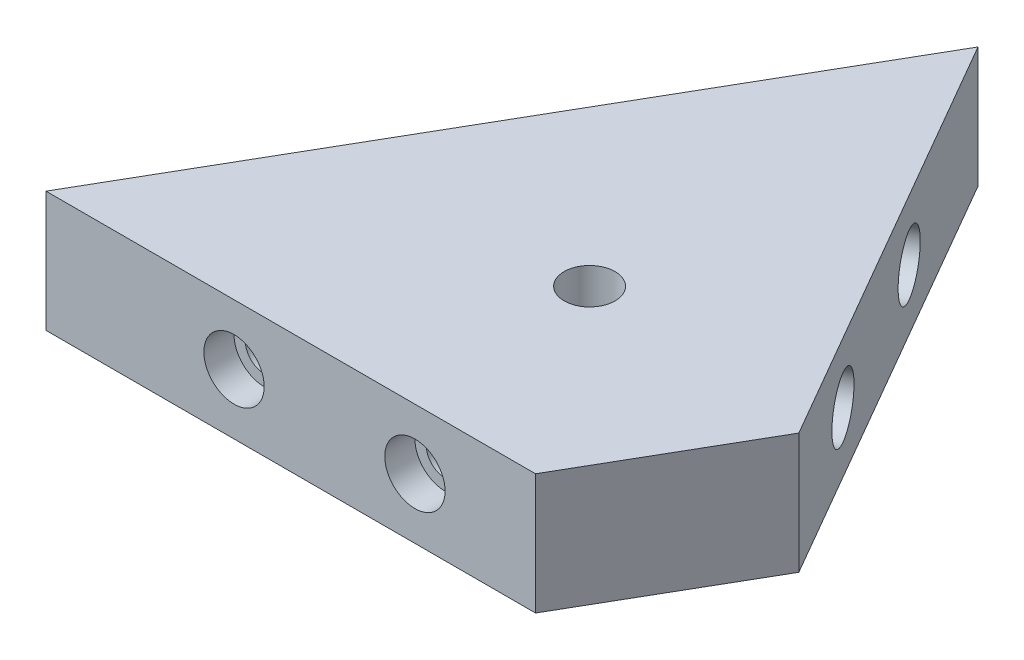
ISO-10303-21;
HEADER;
FILE_DESCRIPTION(('STEP AP214'),'2;1');
FILE_NAME('part.step','',(''),(''),'','','');
FILE_SCHEMA(('AUTOMOTIVE_DESIGN { 1 0 10303 214 1 1 1 1 }'));
ENDSEC;
DATA;
#1=APPLICATION_CONTEXT('core data for automotive mechanical design processes');
#2=APPLICATION_PROTOCOL_DEFINITION('international standard','automotive_design',2000,#1);
#3=PRODUCT_CONTEXT('',#1,'mechanical');
#4=PRODUCT('Part','Part','',(#3));
#5=PRODUCT_RELATED_PRODUCT_CATEGORY('part','',(#4));
#6=PRODUCT_DEFINITION_FORMATION('','',#4);
#7=PRODUCT_DEFINITION_CONTEXT('part definition',#1,'design');
#8=PRODUCT_DEFINITION('design','',#6,#7);
#9=PRODUCT_DEFINITION_SHAPE('','',#8);
#10=(LENGTH_UNIT() NAMED_UNIT(*) SI_UNIT(.MILLI.,.METRE.));
#11=(NAMED_UNIT(*) PLANE_ANGLE_UNIT() SI_UNIT($,.RADIAN.));
#12=(NAMED_UNIT(*) SI_UNIT($,.STERADIAN.) SOLID_ANGLE_UNIT());
#13=UNCERTAINTY_MEASURE_WITH_UNIT(LENGTH_MEASURE(1.E-05),#10,'distance_accuracy_value','');
#14=(GEOMETRIC_REPRESENTATION_CONTEXT(3) GLOBAL_UNCERTAINTY_ASSIGNED_CONTEXT((#13)) GLOBAL_UNIT_ASSIGNED_CONTEXT((#10,
#11,#12)) REPRESENTATION_CONTEXT('',''));
#15=CARTESIAN_POINT('',(0.,0.,0.));
#16=DIRECTION('',(0.,0.,1.));
#17=DIRECTION('',(1.,0.,0.));
#18=AXIS2_PLACEMENT_3D('',#15,#16,#17);
#19=CARTESIAN_POINT('',(15.973610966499,25.4,241.162389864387));
#20=DIRECTION('',(0.,0.,-1.));
#21=DIRECTION('',(-1.,0.,0.));
#22=AXIS2_PLACEMENT_3D('',#19,#20,#21);
#23=PLANE('',#22);
#24=CARTESIAN_POINT('',(55.5682924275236,12.7,241.162389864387));
#25=DIRECTION('',(0.,0.,1.));
#26=DIRECTION('',(1.,0.,0.));
#27=AXIS2_PLACEMENT_3D('',#24,#25,#26);
#28=CIRCLE('',#27,6.35);
#29=CARTESIAN_POINT('',(61.9182924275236,12.7,241.162389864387));
#30=VERTEX_POINT('',#29);
#31=EDGE_CURVE('E187',#30,#30,#28,.T.);
#32=ORIENTED_EDGE('',*,*,#31,.F.);
#33=EDGE_LOOP('',(#32));
#34=FACE_BOUND('',#33,.T.);
#35=CARTESIAN_POINT('',(93.6682924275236,12.7,241.162389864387));
#36=DIRECTION('',(0.,0.,1.));
#37=DIRECTION('',(1.,0.,0.));
#38=AXIS2_PLACEMENT_3D('',#35,#36,#37);
#39=CIRCLE('',#38,6.35);
#40=CARTESIAN_POINT('',(100.018292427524,12.7,241.162389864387));
#41=VERTEX_POINT('',#40);
#42=EDGE_CURVE('E191',#41,#41,#39,.T.);
#43=ORIENTED_EDGE('',*,*,#42,.F.);
#44=EDGE_LOOP('',(#43));
#45=FACE_BOUND('',#44,.T.);
#46=DIRECTION('',(1.,0.,0.));
#47=VECTOR('',#46,1.);
#48=CARTESIAN_POINT('',(15.973610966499,0.,241.162389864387));
#49=LINE('',#48,#47);
#50=CARTESIAN_POINT('',(15.973610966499,0.,241.162389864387));
#51=VERTEX_POINT('',#50);
#52=CARTESIAN_POINT('',(119.068292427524,0.,241.162389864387));
#53=VERTEX_POINT('',#52);
#54=EDGE_CURVE('E186',#51,#53,#49,.T.);
#55=ORIENTED_EDGE('',*,*,#54,.T.);
#56=DIRECTION('',(0.,-1.,0.));
#57=VECTOR('',#56,1.);
#58=CARTESIAN_POINT('',(119.068292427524,25.4,241.162389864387));
#59=LINE('',#58,#57);
#60=CARTESIAN_POINT('',(119.068292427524,25.4,241.162389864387));
#61=VERTEX_POINT('',#60);
#62=EDGE_CURVE('E11',#61,#53,#59,.T.);
#63=ORIENTED_EDGE('',*,*,#62,.F.);
#64=DIRECTION('',(1.,0.,0.));
#65=VECTOR('',#64,1.);
#66=CARTESIAN_POINT('',(15.973610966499,25.4,241.162389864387));
#67=LINE('',#66,#65);
#68=CARTESIAN_POINT('',(15.973610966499,25.4,241.162389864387));
#69=VERTEX_POINT('',#68);
#70=EDGE_CURVE('E198',#69,#61,#67,.T.);
#71=ORIENTED_EDGE('',*,*,#70,.F.);
#72=DIRECTION('',(0.,-1.,0.));
#73=VECTOR('',#72,1.);
#74=CARTESIAN_POINT('',(15.973610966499,25.4,241.162389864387));
#75=LINE('',#74,#73);
#76=EDGE_CURVE('E57',#69,#51,#75,.T.);
#77=ORIENTED_EDGE('',*,*,#76,.T.);
#78=EDGE_LOOP('',(#55,#63,#71,#77));
#79=FACE_BOUND('',#78,.T.);
#80=ADVANCED_FACE('F48',(#34,#45,#79),#23,.F.);
#81=CARTESIAN_POINT('',(119.068292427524,25.4,241.162389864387));
#82=DIRECTION('',(-0.866025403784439,0.,-0.5));
#83=DIRECTION('',(-0.5,0.,0.866025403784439));
#84=AXIS2_PLACEMENT_3D('',#81,#82,#83);
#85=PLANE('',#84);
#86=DIRECTION('',(0.5,0.,-0.866025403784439));
#87=VECTOR('',#86,1.);
#88=CARTESIAN_POINT('',(119.068292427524,0.,241.162389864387));
#89=LINE('',#88,#87);
#90=CARTESIAN_POINT('',(139.363860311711,0.,206.009435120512));
#91=VERTEX_POINT('',#90);
#92=EDGE_CURVE('E77',#53,#91,#89,.T.);
#93=ORIENTED_EDGE('',*,*,#92,.T.);
#94=DIRECTION('',(0.,-1.,0.));
#95=VECTOR('',#94,1.);
#96=CARTESIAN_POINT('',(139.363860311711,25.4,206.009435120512));
#97=LINE('',#96,#95);
#98=CARTESIAN_POINT('',(139.363860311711,25.4,206.009435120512));
#99=VERTEX_POINT('',#98);
#100=EDGE_CURVE('E155',#99,#91,#97,.T.);
#101=ORIENTED_EDGE('',*,*,#100,.F.);
#102=DIRECTION('',(0.5,0.,-0.866025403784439));
#103=VECTOR('',#102,1.);
#104=CARTESIAN_POINT('',(119.068292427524,25.4,241.162389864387));
#105=LINE('',#104,#103);
#106=EDGE_CURVE('E201',#61,#99,#105,.T.);
#107=ORIENTED_EDGE('',*,*,#106,.F.);
#108=ORIENTED_EDGE('',*,*,#62,.T.);
#109=EDGE_LOOP('',(#93,#101,#107,#108));
#110=FACE_BOUND('',#109,.T.);
#111=ADVANCED_FACE('F227',(#110),#85,.F.);
#112=CARTESIAN_POINT('',(15.973610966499,25.4,241.162389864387));
#113=DIRECTION('',(0.866025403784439,0.,0.5));
#114=DIRECTION('',(0.5,0.,-0.866025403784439));
#115=AXIS2_PLACEMENT_3D('',#112,#113,#114);
#116=PLANE('',#115);
#117=DIRECTION('',(-0.5,0.,0.866025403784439));
#118=VECTOR('',#117,1.);
#119=CARTESIAN_POINT('',(15.973610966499,0.,241.162389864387));
#120=LINE('',#119,#118);
#121=CARTESIAN_POINT('',(87.8165195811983,0.,116.7268219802));
#122=VERTEX_POINT('',#121);
#123=EDGE_CURVE('E202',#122,#51,#120,.T.);
#124=ORIENTED_EDGE('',*,*,#123,.T.);
#125=ORIENTED_EDGE('',*,*,#76,.F.);
#126=DIRECTION('',(-0.5,0.,0.866025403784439));
#127=VECTOR('',#126,1.);
#128=CARTESIAN_POINT('',(15.973610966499,25.4,241.162389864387));
#129=LINE('',#128,#127);
#130=CARTESIAN_POINT('',(87.8165195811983,25.4,116.7268219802));
#131=VERTEX_POINT('',#130);
#132=EDGE_CURVE('E65',#131,#69,#129,.T.);
#133=ORIENTED_EDGE('',*,*,#132,.F.);
#134=DIRECTION('',(0.,-1.,0.));
#135=VECTOR('',#134,1.);
#136=CARTESIAN_POINT('',(87.8165195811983,25.4,116.7268219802));
#137=LINE('',#136,#135);
#138=EDGE_CURVE('E161',#131,#122,#137,.T.);
#139=ORIENTED_EDGE('',*,*,#138,.T.);
#140=EDGE_LOOP('',(#124,#125,#133,#139));
#141=FACE_BOUND('',#140,.T.);
#142=ADVANCED_FACE('F222',(#141),#116,.F.);
#143=CARTESIAN_POINT('',(0.,25.4,0.));
#144=DIRECTION('',(0.,1.,0.));
#145=DIRECTION('',(0.,0.,1.));
#146=AXIS2_PLACEMENT_3D('',#143,#144,#145);
#147=PLANE('',#146);
#148=CARTESIAN_POINT('',(90.5555708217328,25.4,201.265259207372));
#149=DIRECTION('',(0.,1.,0.));
#150=DIRECTION('',(0.,0.,1.));
#151=AXIS2_PLACEMENT_3D('',#148,#149,#150);
#152=CIRCLE('',#151,5.35812999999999);
#153=CARTESIAN_POINT('',(90.5555708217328,25.4,206.623389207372));
#154=VERTEX_POINT('',#153);
#155=EDGE_CURVE('E126',#154,#154,#152,.T.);
#156=ORIENTED_EDGE('',*,*,#155,.F.);
#157=EDGE_LOOP('',(#156));
#158=FACE_BOUND('',#157,.T.);
#159=ORIENTED_EDGE('',*,*,#70,.T.);
#160=ORIENTED_EDGE('',*,*,#106,.T.);
#161=DIRECTION('',(0.5,0.,0.866025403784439));
#162=VECTOR('',#161,1.);
#163=CARTESIAN_POINT('',(87.8165195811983,25.4,116.7268219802));
#164=LINE('',#163,#162);
#165=EDGE_CURVE('E151',#131,#99,#164,.T.);
#166=ORIENTED_EDGE('',*,*,#165,.F.);
#167=ORIENTED_EDGE('',*,*,#132,.T.);
#168=EDGE_LOOP('',(#159,#160,#166,#167));
#169=FACE_BOUND('',#168,.T.);
#170=ADVANCED_FACE('F228',(#158,#169),#147,.T.);
#171=CARTESIAN_POINT('',(0.,0.,0.));
#172=DIRECTION('',(0.,1.,0.));
#173=DIRECTION('',(0.,0.,1.));
#174=AXIS2_PLACEMENT_3D('',#171,#172,#173);
#175=PLANE('',#174);
#176=CARTESIAN_POINT('',(90.5555708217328,0.,201.265259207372));
#177=DIRECTION('',(0.,1.,0.));
#178=DIRECTION('',(0.,0.,1.));
#179=AXIS2_PLACEMENT_3D('',#176,#177,#178);
#180=CIRCLE('',#179,5.35812999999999);
#181=CARTESIAN_POINT('',(90.5555708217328,0.,206.623389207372));
#182=VERTEX_POINT('',#181);
#183=EDGE_CURVE('E130',#182,#182,#180,.T.);
#184=ORIENTED_EDGE('',*,*,#183,.T.);
#185=EDGE_LOOP('',(#184));
#186=FACE_BOUND('',#185,.T.);
#187=ORIENTED_EDGE('',*,*,#54,.F.);
#188=ORIENTED_EDGE('',*,*,#123,.F.);
#189=DIRECTION('',(0.5,0.,0.866025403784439));
#190=VECTOR('',#189,1.);
#191=CARTESIAN_POINT('',(87.8165195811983,0.,116.7268219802));
#192=LINE('',#191,#190);
#193=EDGE_CURVE('E139',#122,#91,#192,.T.);
#194=ORIENTED_EDGE('',*,*,#193,.T.);
#195=ORIENTED_EDGE('',*,*,#92,.F.);
#196=EDGE_LOOP('',(#187,#188,#194,#195));
#197=FACE_BOUND('',#196,.T.);
#198=ADVANCED_FACE('F219',(#186,#197),#175,.F.);
#199=CARTESIAN_POINT('',(93.6682924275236,12.7,234.812389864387));
#200=DIRECTION('',(0.,0.,1.));
#201=DIRECTION('',(1.,0.,0.));
#202=AXIS2_PLACEMENT_3D('',#199,#200,#201);
#203=CYLINDRICAL_SURFACE('',#202,6.35);
#204=CARTESIAN_POINT('',(93.6682924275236,12.7,234.812389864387));
#205=DIRECTION('',(0.,0.,1.));
#206=DIRECTION('',(1.,0.,0.));
#207=AXIS2_PLACEMENT_3D('',#204,#205,#206);
#208=CIRCLE('',#207,6.35);
#209=CARTESIAN_POINT('',(100.018292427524,12.7,234.812389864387));
#210=VERTEX_POINT('',#209);
#211=EDGE_CURVE('E181',#210,#210,#208,.T.);
#212=ORIENTED_EDGE('',*,*,#211,.F.);
#213=EDGE_LOOP('',(#212));
#214=FACE_BOUND('',#213,.T.);
#215=ORIENTED_EDGE('',*,*,#42,.T.);
#216=EDGE_LOOP('',(#215));
#217=FACE_BOUND('',#216,.T.);
#218=ADVANCED_FACE('F237',(#214,#217),#203,.F.);
#219=CARTESIAN_POINT('',(93.6682924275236,12.7,234.812389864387));
#220=DIRECTION('',(0.,0.,1.));
#221=DIRECTION('',(1.,0.,0.));
#222=AXIS2_PLACEMENT_3D('',#219,#220,#221);
#223=PLANE('',#222);
#224=CARTESIAN_POINT('',(93.6682924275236,12.7,234.812389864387));
#225=DIRECTION('',(0.,0.,1.));
#226=DIRECTION('',(1.,0.,0.));
#227=AXIS2_PLACEMENT_3D('',#224,#225,#226);
#228=CIRCLE('',#227,3.96874999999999);
#229=CARTESIAN_POINT('',(97.6370424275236,12.7,234.812389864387));
#230=VERTEX_POINT('',#229);
#231=EDGE_CURVE('E165',#230,#230,#228,.T.);
#232=ORIENTED_EDGE('',*,*,#231,.F.);
#233=EDGE_LOOP('',(#232));
#234=FACE_BOUND('',#233,.T.);
#235=ORIENTED_EDGE('',*,*,#211,.T.);
#236=EDGE_LOOP('',(#235));
#237=FACE_BOUND('',#236,.T.);
#238=ADVANCED_FACE('F254',(#234,#237),#223,.T.);
#239=CARTESIAN_POINT('',(55.5682924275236,12.7,234.812389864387));
#240=DIRECTION('',(0.,0.,1.));
#241=DIRECTION('',(1.,0.,0.));
#242=AXIS2_PLACEMENT_3D('',#239,#240,#241);
#243=CYLINDRICAL_SURFACE('',#242,6.35);
#244=CARTESIAN_POINT('',(55.5682924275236,12.7,234.812389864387));
#245=DIRECTION('',(0.,0.,1.));
#246=DIRECTION('',(1.,0.,0.));
#247=AXIS2_PLACEMENT_3D('',#244,#245,#246);
#248=CIRCLE('',#247,6.35);
#249=CARTESIAN_POINT('',(61.9182924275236,12.7,234.812389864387));
#250=VERTEX_POINT('',#249);
#251=EDGE_CURVE('E182',#250,#250,#248,.T.);
#252=ORIENTED_EDGE('',*,*,#251,.F.);
#253=EDGE_LOOP('',(#252));
#254=FACE_BOUND('',#253,.T.);
#255=ORIENTED_EDGE('',*,*,#31,.T.);
#256=EDGE_LOOP('',(#255));
#257=FACE_BOUND('',#256,.T.);
#258=ADVANCED_FACE('F261',(#254,#257),#243,.F.);
#259=CARTESIAN_POINT('',(55.5682924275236,12.7,234.812389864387));
#260=DIRECTION('',(0.,0.,1.));
#261=DIRECTION('',(1.,0.,0.));
#262=AXIS2_PLACEMENT_3D('',#259,#260,#261);
#263=PLANE('',#262);
#264=CARTESIAN_POINT('',(55.5682924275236,12.7,234.812389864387));
#265=DIRECTION('',(0.,0.,1.));
#266=DIRECTION('',(1.,0.,0.));
#267=AXIS2_PLACEMENT_3D('',#264,#265,#266);
#268=CIRCLE('',#267,3.96875);
#269=CARTESIAN_POINT('',(59.5370424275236,12.7,234.812389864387));
#270=VERTEX_POINT('',#269);
#271=EDGE_CURVE('E173',#270,#270,#268,.T.);
#272=ORIENTED_EDGE('',*,*,#271,.F.);
#273=EDGE_LOOP('',(#272));
#274=FACE_BOUND('',#273,.T.);
#275=ORIENTED_EDGE('',*,*,#251,.T.);
#276=EDGE_LOOP('',(#275));
#277=FACE_BOUND('',#276,.T.);
#278=ADVANCED_FACE('F266',(#274,#277),#263,.T.);
#279=CARTESIAN_POINT('',(55.5682924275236,12.7,218.937389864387));
#280=DIRECTION('',(0.,0.,1.));
#281=DIRECTION('',(1.,0.,0.));
#282=AXIS2_PLACEMENT_3D('',#279,#280,#281);
#283=CONICAL_SURFACE('',#282,3.96874999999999,1.02974425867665);
#284=CARTESIAN_POINT('',(55.5682924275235,12.7,216.552724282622));
#285=VERTEX_POINT('',#284);
#286=VERTEX_LOOP('',#285);
#287=FACE_BOUND('',#286,.T.);
#288=CARTESIAN_POINT('',(55.5682924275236,12.7,218.937389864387));
#289=DIRECTION('',(0.,0.,1.));
#290=DIRECTION('',(1.,0.,0.));
#291=AXIS2_PLACEMENT_3D('',#288,#289,#290);
#292=CIRCLE('',#291,3.96874999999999);
#293=CARTESIAN_POINT('',(59.5370424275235,12.7,218.937389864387));
#294=VERTEX_POINT('',#293);
#295=EDGE_CURVE('E177',#294,#294,#292,.T.);
#296=ORIENTED_EDGE('',*,*,#295,.T.);
#297=EDGE_LOOP('',(#296));
#298=FACE_BOUND('',#297,.T.);
#299=ADVANCED_FACE('F270',(#287,#298),#283,.F.);
#300=CARTESIAN_POINT('',(55.5682924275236,12.7,234.812389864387));
#301=DIRECTION('',(0.,0.,1.));
#302=DIRECTION('',(1.,0.,0.));
#303=AXIS2_PLACEMENT_3D('',#300,#301,#302);
#304=CYLINDRICAL_SURFACE('',#303,3.96875);
#305=ORIENTED_EDGE('',*,*,#295,.F.);
#306=EDGE_LOOP('',(#305));
#307=FACE_BOUND('',#306,.T.);
#308=ORIENTED_EDGE('',*,*,#271,.T.);
#309=EDGE_LOOP('',(#308));
#310=FACE_BOUND('',#309,.T.);
#311=ADVANCED_FACE('F274',(#307,#310),#304,.F.);
#312=CARTESIAN_POINT('',(93.6682924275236,12.7,218.937389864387));
#313=DIRECTION('',(0.,0.,1.));
#314=DIRECTION('',(1.,0.,0.));
#315=AXIS2_PLACEMENT_3D('',#312,#313,#314);
#316=CONICAL_SURFACE('',#315,3.96874999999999,1.02974425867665);
#317=CARTESIAN_POINT('',(93.6682924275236,12.7,216.552724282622));
#318=VERTEX_POINT('',#317);
#319=VERTEX_LOOP('',#318);
#320=FACE_BOUND('',#319,.T.);
#321=CARTESIAN_POINT('',(93.6682924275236,12.7,218.937389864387));
#322=DIRECTION('',(0.,0.,1.));
#323=DIRECTION('',(1.,0.,0.));
#324=AXIS2_PLACEMENT_3D('',#321,#322,#323);
#325=CIRCLE('',#324,3.96874999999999);
#326=CARTESIAN_POINT('',(97.6370424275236,12.7,218.937389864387));
#327=VERTEX_POINT('',#326);
#328=EDGE_CURVE('E169',#327,#327,#325,.T.);
#329=ORIENTED_EDGE('',*,*,#328,.T.);
#330=EDGE_LOOP('',(#329));
#331=FACE_BOUND('',#330,.T.);
#332=ADVANCED_FACE('F277',(#320,#331),#316,.F.);
#333=CARTESIAN_POINT('',(93.6682924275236,12.7,234.812389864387));
#334=DIRECTION('',(0.,0.,1.));
#335=DIRECTION('',(1.,0.,0.));
#336=AXIS2_PLACEMENT_3D('',#333,#334,#335);
#337=CYLINDRICAL_SURFACE('',#336,3.96874999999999);
#338=ORIENTED_EDGE('',*,*,#328,.F.);
#339=EDGE_LOOP('',(#338));
#340=FACE_BOUND('',#339,.T.);
#341=ORIENTED_EDGE('',*,*,#231,.T.);
#342=EDGE_LOOP('',(#341));
#343=FACE_BOUND('',#342,.T.);
#344=ADVANCED_FACE('F281',(#340,#343),#337,.F.);
#345=CARTESIAN_POINT('',(87.8165195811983,25.4,116.7268219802));
#346=DIRECTION('',(0.866025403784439,0.,-0.5));
#347=DIRECTION('',(-0.5,0.,-0.866025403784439));
#348=AXIS2_PLACEMENT_3D('',#345,#346,#347);
#349=PLANE('',#348);
#350=CARTESIAN_POINT('',(107.613860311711,12.7,151.0168219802));
#351=DIRECTION('',(-0.866025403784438,0.,0.500000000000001));
#352=DIRECTION('',(0.5,0.,0.866025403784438));
#353=AXIS2_PLACEMENT_3D('',#350,#351,#352);
#354=CIRCLE('',#353,6.35);
#355=CARTESIAN_POINT('',(110.788860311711,12.7,156.516083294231));
#356=VERTEX_POINT('',#355);
#357=EDGE_CURVE('E140',#356,#356,#354,.T.);
#358=ORIENTED_EDGE('',*,*,#357,.T.);
#359=EDGE_LOOP('',(#358));
#360=FACE_BOUND('',#359,.T.);
#361=CARTESIAN_POINT('',(126.663860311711,12.7,184.012389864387));
#362=DIRECTION('',(-0.866025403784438,0.,0.500000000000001));
#363=DIRECTION('',(0.5,0.,0.866025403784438));
#364=AXIS2_PLACEMENT_3D('',#361,#362,#363);
#365=CIRCLE('',#364,6.35);
#366=CARTESIAN_POINT('',(129.838860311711,12.7,189.511651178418));
#367=VERTEX_POINT('',#366);
#368=EDGE_CURVE('E134',#367,#367,#365,.T.);
#369=ORIENTED_EDGE('',*,*,#368,.T.);
#370=EDGE_LOOP('',(#369));
#371=FACE_BOUND('',#370,.T.);
#372=ORIENTED_EDGE('',*,*,#193,.F.);
#373=ORIENTED_EDGE('',*,*,#138,.F.);
#374=ORIENTED_EDGE('',*,*,#165,.T.);
#375=ORIENTED_EDGE('',*,*,#100,.T.);
#376=EDGE_LOOP('',(#372,#373,#374,#375));
#377=FACE_BOUND('',#376,.T.);
#378=ADVANCED_FACE('F224',(#360,#371,#377),#349,.T.);
#379=CARTESIAN_POINT('',(121.164598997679,12.7,187.187389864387));
#380=DIRECTION('',(0.866025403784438,0.,-0.500000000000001));
#381=DIRECTION('',(-0.500000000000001,0.,-0.866025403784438));
#382=AXIS2_PLACEMENT_3D('',#379,#380,#381);
#383=CYLINDRICAL_SURFACE('',#382,6.35);
#384=CARTESIAN_POINT('',(121.164598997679,12.7,187.187389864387));
#385=DIRECTION('',(-0.866025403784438,0.,0.500000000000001));
#386=DIRECTION('',(0.5,0.,0.866025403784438));
#387=AXIS2_PLACEMENT_3D('',#384,#385,#386);
#388=CIRCLE('',#387,6.35);
#389=CARTESIAN_POINT('',(124.339598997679,12.7,192.686651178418));
#390=VERTEX_POINT('',#389);
#391=EDGE_CURVE('E144',#390,#390,#388,.T.);
#392=ORIENTED_EDGE('',*,*,#391,.T.);
#393=EDGE_LOOP('',(#392));
#394=FACE_BOUND('',#393,.T.);
#395=ORIENTED_EDGE('',*,*,#368,.F.);
#396=EDGE_LOOP('',(#395));
#397=FACE_BOUND('',#396,.T.);
#398=ADVANCED_FACE('F288',(#394,#397),#383,.F.);
#399=CARTESIAN_POINT('',(121.164598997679,12.7,187.187389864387));
#400=DIRECTION('',(0.866025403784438,0.,-0.500000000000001));
#401=DIRECTION('',(0.5,0.,0.866025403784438));
#402=AXIS2_PLACEMENT_3D('',#399,#400,#401);
#403=PLANE('',#402);
#404=CARTESIAN_POINT('',(121.164598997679,12.7,187.187389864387));
#405=DIRECTION('',(0.866025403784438,0.,-0.500000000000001));
#406=DIRECTION('',(-0.500000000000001,0.,-0.866025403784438));
#407=AXIS2_PLACEMENT_3D('',#404,#405,#406);
#408=CIRCLE('',#407,3.96875);
#409=CARTESIAN_POINT('',(119.180223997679,12.7,183.750351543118));
#410=VERTEX_POINT('',#409);
#411=EDGE_CURVE('E112',#410,#410,#408,.T.);
#412=ORIENTED_EDGE('',*,*,#411,.F.);
#413=EDGE_LOOP('',(#412));
#414=FACE_BOUND('',#413,.T.);
#415=ORIENTED_EDGE('',*,*,#391,.F.);
#416=EDGE_LOOP('',(#415));
#417=FACE_BOUND('',#416,.T.);
#418=ADVANCED_FACE('F292',(#414,#417),#403,.T.);
#419=CARTESIAN_POINT('',(102.114598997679,12.7,154.1918219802));
#420=DIRECTION('',(0.866025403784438,0.,-0.500000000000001));
#421=DIRECTION('',(-0.500000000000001,0.,-0.866025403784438));
#422=AXIS2_PLACEMENT_3D('',#419,#420,#421);
#423=CYLINDRICAL_SURFACE('',#422,6.35);
#424=CARTESIAN_POINT('',(102.114598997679,12.7,154.1918219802));
#425=DIRECTION('',(-0.866025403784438,0.,0.500000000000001));
#426=DIRECTION('',(0.5,0.,0.866025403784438));
#427=AXIS2_PLACEMENT_3D('',#424,#425,#426);
#428=CIRCLE('',#427,6.35);
#429=CARTESIAN_POINT('',(105.289598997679,12.7,159.691083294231));
#430=VERTEX_POINT('',#429);
#431=EDGE_CURVE('E135',#430,#430,#428,.T.);
#432=ORIENTED_EDGE('',*,*,#431,.T.);
#433=EDGE_LOOP('',(#432));
#434=FACE_BOUND('',#433,.T.);
#435=ORIENTED_EDGE('',*,*,#357,.F.);
#436=EDGE_LOOP('',(#435));
#437=FACE_BOUND('',#436,.T.);
#438=ADVANCED_FACE('F296',(#434,#437),#423,.F.);
#439=CARTESIAN_POINT('',(102.114598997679,12.7,154.1918219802));
#440=DIRECTION('',(0.866025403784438,0.,-0.500000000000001));
#441=DIRECTION('',(0.5,0.,0.866025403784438));
#442=AXIS2_PLACEMENT_3D('',#439,#440,#441);
#443=PLANE('',#442);
#444=CARTESIAN_POINT('',(102.114598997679,12.7,154.1918219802));
#445=DIRECTION('',(0.866025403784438,0.,-0.500000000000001));
#446=DIRECTION('',(-0.500000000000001,0.,-0.866025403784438));
#447=AXIS2_PLACEMENT_3D('',#444,#445,#446);
#448=CIRCLE('',#447,3.96875);
#449=CARTESIAN_POINT('',(100.130223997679,12.7,150.754783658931));
#450=VERTEX_POINT('',#449);
#451=EDGE_CURVE('E113',#450,#450,#448,.T.);
#452=ORIENTED_EDGE('',*,*,#451,.F.);
#453=EDGE_LOOP('',(#452));
#454=FACE_BOUND('',#453,.T.);
#455=ORIENTED_EDGE('',*,*,#431,.F.);
#456=EDGE_LOOP('',(#455));
#457=FACE_BOUND('',#456,.T.);
#458=ADVANCED_FACE('F300',(#454,#457),#443,.T.);
#459=CARTESIAN_POINT('',(90.5555708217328,25.4,201.265259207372));
#460=DIRECTION('',(0.,1.,0.));
#461=DIRECTION('',(0.,0.,1.));
#462=AXIS2_PLACEMENT_3D('',#459,#460,#461);
#463=CYLINDRICAL_SURFACE('',#462,5.35812999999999);
#464=ORIENTED_EDGE('',*,*,#183,.F.);
#465=EDGE_LOOP('',(#464));
#466=FACE_BOUND('',#465,.T.);
#467=ORIENTED_EDGE('',*,*,#155,.T.);
#468=EDGE_LOOP('',(#467));
#469=FACE_BOUND('',#468,.T.);
#470=ADVANCED_FACE('F304',(#466,#469),#463,.F.);
#471=CARTESIAN_POINT('',(107.416445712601,12.7,195.124889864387));
#472=DIRECTION('',(0.866025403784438,0.,-0.500000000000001));
#473=DIRECTION('',(-0.500000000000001,0.,-0.866025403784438));
#474=AXIS2_PLACEMENT_3D('',#471,#472,#473);
#475=CONICAL_SURFACE('',#474,3.96875,1.02974425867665);
#476=CARTESIAN_POINT('',(105.351264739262,12.7,196.31722265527));
#477=VERTEX_POINT('',#476);
#478=VERTEX_LOOP('',#477);
#479=FACE_BOUND('',#478,.T.);
#480=CARTESIAN_POINT('',(107.416445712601,12.7,195.124889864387));
#481=DIRECTION('',(0.866025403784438,0.,-0.500000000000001));
#482=DIRECTION('',(-0.500000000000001,0.,-0.866025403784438));
#483=AXIS2_PLACEMENT_3D('',#480,#481,#482);
#484=CIRCLE('',#483,3.96875);
#485=CARTESIAN_POINT('',(105.432070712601,12.7,191.687851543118));
#486=VERTEX_POINT('',#485);
#487=EDGE_CURVE('E118',#486,#486,#484,.T.);
#488=ORIENTED_EDGE('',*,*,#487,.T.);
#489=EDGE_LOOP('',(#488));
#490=FACE_BOUND('',#489,.T.);
#491=ADVANCED_FACE('F308',(#479,#490),#475,.F.);
#492=CARTESIAN_POINT('',(121.164598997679,12.7,187.187389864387));
#493=DIRECTION('',(0.866025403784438,0.,-0.500000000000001));
#494=DIRECTION('',(-0.500000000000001,0.,-0.866025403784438));
#495=AXIS2_PLACEMENT_3D('',#492,#493,#494);
#496=CYLINDRICAL_SURFACE('',#495,3.96875);
#497=CARTESIAN_POINT('',(105.432070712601,12.7,191.687851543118));
#498=CARTESIAN_POINT('',(105.575280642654,12.7,191.605169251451));
#499=CARTESIAN_POINT('',(105.718490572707,12.7,191.522486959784));
#500=CARTESIAN_POINT('',(106.004910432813,12.7,191.357122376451));
#501=CARTESIAN_POINT('',(106.148120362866,12.7,191.274440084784));
#502=CARTESIAN_POINT('',(106.434540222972,12.7,191.109075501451));
#503=CARTESIAN_POINT('',(106.577750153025,12.7,191.026393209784));
#504=CARTESIAN_POINT('',(106.86417001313,12.7,190.861028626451));
#505=CARTESIAN_POINT('',(107.007379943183,12.7,190.778346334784));
#506=CARTESIAN_POINT('',(107.293799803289,12.7,190.612981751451));
#507=CARTESIAN_POINT('',(107.437009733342,12.7,190.530299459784));
#508=CARTESIAN_POINT('',(107.723429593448,12.7,190.364934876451));
#509=CARTESIAN_POINT('',(107.866639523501,12.7,190.282252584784));
#510=CARTESIAN_POINT('',(108.153059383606,12.7,190.116888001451));
#511=CARTESIAN_POINT('',(108.296269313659,12.7,190.034205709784));
#512=CARTESIAN_POINT('',(108.582689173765,12.7,189.868841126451));
#513=CARTESIAN_POINT('',(108.725899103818,12.7,189.786158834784));
#514=CARTESIAN_POINT('',(109.012318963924,12.7,189.620794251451));
#515=CARTESIAN_POINT('',(109.155528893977,12.7,189.538111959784));
#516=CARTESIAN_POINT('',(109.441948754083,12.7,189.372747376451));
#517=CARTESIAN_POINT('',(109.585158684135,12.7,189.290065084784));
#518=CARTESIAN_POINT('',(109.871578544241,12.7,189.124700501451));
#519=CARTESIAN_POINT('',(110.014788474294,12.7,189.042018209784));
#520=CARTESIAN_POINT('',(110.3012083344,12.7,188.876653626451));
#521=CARTESIAN_POINT('',(110.444418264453,12.7,188.793971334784));
#522=CARTESIAN_POINT('',(110.730838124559,12.7,188.628606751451));
#523=CARTESIAN_POINT('',(110.874048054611,12.7,188.545924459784));
#524=CARTESIAN_POINT('',(111.160467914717,12.7,188.380559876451));
#525=CARTESIAN_POINT('',(111.30367784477,12.7,188.297877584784));
#526=CARTESIAN_POINT('',(111.590097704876,12.7,188.132513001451));
#527=CARTESIAN_POINT('',(111.733307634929,12.7,188.049830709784));
#528=CARTESIAN_POINT('',(112.019727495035,12.7,187.884466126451));
#529=CARTESIAN_POINT('',(112.162937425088,12.7,187.801783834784));
#530=CARTESIAN_POINT('',(112.449357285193,12.7,187.636419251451));
#531=CARTESIAN_POINT('',(112.592567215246,12.7,187.553736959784));
#532=CARTESIAN_POINT('',(112.878987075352,12.7,187.388372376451));
#533=CARTESIAN_POINT('',(113.022197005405,12.7,187.305690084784));
#534=CARTESIAN_POINT('',(113.308616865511,12.7,187.140325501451));
#535=CARTESIAN_POINT('',(113.451826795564,12.7,187.057643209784));
#536=CARTESIAN_POINT('',(113.738246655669,12.7,186.892278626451));
#537=CARTESIAN_POINT('',(113.881456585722,12.7,186.809596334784));
#538=CARTESIAN_POINT('',(114.167876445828,12.7,186.644231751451));
#539=CARTESIAN_POINT('',(114.311086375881,12.7,186.561549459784));
#540=CARTESIAN_POINT('',(114.597506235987,12.7,186.396184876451));
#541=CARTESIAN_POINT('',(114.74071616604,12.7,186.313502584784));
#542=CARTESIAN_POINT('',(115.027136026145,12.7,186.148138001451));
#543=CARTESIAN_POINT('',(115.170345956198,12.7,186.065455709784));
#544=CARTESIAN_POINT('',(115.456765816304,12.7,185.900091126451));
#545=CARTESIAN_POINT('',(115.599975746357,12.7,185.817408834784));
#546=CARTESIAN_POINT('',(115.886395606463,12.7,185.652044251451));
#547=CARTESIAN_POINT('',(116.029605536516,12.7,185.569361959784));
#548=CARTESIAN_POINT('',(116.316025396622,12.7,185.403997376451));
#549=CARTESIAN_POINT('',(116.459235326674,12.7,185.321315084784));
#550=CARTESIAN_POINT('',(116.74565518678,12.7,185.155950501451));
#551=CARTESIAN_POINT('',(116.888865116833,12.7,185.073268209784));
#552=CARTESIAN_POINT('',(117.175284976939,12.7,184.907903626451));
#553=CARTESIAN_POINT('',(117.318494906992,12.7,184.825221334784));
#554=CARTESIAN_POINT('',(117.604914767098,12.7,184.659856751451));
#555=CARTESIAN_POINT('',(117.74812469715,12.7,184.577174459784));
#556=CARTESIAN_POINT('',(118.034544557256,12.7,184.411809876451));
#557=CARTESIAN_POINT('',(118.177754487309,12.7,184.329127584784));
#558=CARTESIAN_POINT('',(118.464174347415,12.7,184.163763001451));
#559=CARTESIAN_POINT('',(118.607384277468,12.7,184.081080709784));
#560=CARTESIAN_POINT('',(118.893804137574,12.7,183.915716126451));
#561=CARTESIAN_POINT('',(119.037014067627,12.7,183.833033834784));
#562=CARTESIAN_POINT('',(119.180223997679,12.7,183.750351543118));
#563=B_SPLINE_CURVE_WITH_KNOTS('',3,(#497,#498,#499,#500,#501,#502,#503,#504,#505,#506,#507,
#508,#509,#510,#511,#512,#513,#514,#515,#516,#517,#518,#519,#520,#521,#522,#523,#524,#525,#526,
#527,#528,#529,#530,#531,#532,#533,#534,#535,#536,#537,#538,#539,#540,#541,#542,#543,#544,#545,
#546,#547,#548,#549,#550,#551,#552,#553,#554,#555,#556,#557,#558,#559,#560,#561,#562),
.UNSPECIFIED.,.F.,.F.,(4,2,2,2,2,2,2,2,2,2,2,2,2,2,2,2,2,2,2,2,2,2,2,2,2,2,2,2,2,2,2,2,4),(0.,
0.496093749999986,0.992187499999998,1.48828125,1.98437499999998,2.48046874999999,
2.97656249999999,3.47265624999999,3.96875,4.46484374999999,4.96093749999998,5.45703125,5.953125,
6.44921874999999,6.94531249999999,7.44140624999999,7.93749999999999,8.43359375,8.9296875,
9.42578124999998,9.92187499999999,10.41796875,10.9140625,11.41015625,11.90625,12.40234375,
12.8984375,13.39453125,13.890625,14.38671875,14.8828125,15.37890625,15.875),.UNSPECIFIED.);
#564=EDGE_CURVE('BSEAM105',#486,#410,#563,.T.);
#565=ORIENTED_EDGE('',*,*,#487,.F.);
#566=ORIENTED_EDGE('',*,*,#411,.T.);
#567=ORIENTED_EDGE('',*,*,#564,.T.);
#568=ORIENTED_EDGE('',*,*,#564,.F.);
#569=EDGE_LOOP('',(#565,#567,#566,#568));
#570=FACE_BOUND('',#569,.T.);
#571=ADVANCED_FACE('F105',(#570),#496,.F.);
#572=CARTESIAN_POINT('',(88.3664457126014,12.7,162.1293219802));
#573=DIRECTION('',(0.866025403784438,0.,-0.500000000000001));
#574=DIRECTION('',(-0.500000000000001,0.,-0.866025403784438));
#575=AXIS2_PLACEMENT_3D('',#572,#573,#574);
#576=CONICAL_SURFACE('',#575,3.96875,1.02974425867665);
#577=CARTESIAN_POINT('',(86.301264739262,12.7,163.321654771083));
#578=VERTEX_POINT('',#577);
#579=VERTEX_LOOP('',#578);
#580=FACE_BOUND('',#579,.T.);
#581=CARTESIAN_POINT('',(88.3664457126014,12.7,162.1293219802));
#582=DIRECTION('',(0.866025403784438,0.,-0.500000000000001));
#583=DIRECTION('',(-0.500000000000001,0.,-0.866025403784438));
#584=AXIS2_PLACEMENT_3D('',#581,#582,#583);
#585=CIRCLE('',#584,3.96875);
#586=CARTESIAN_POINT('',(86.3820707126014,12.7,158.692283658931));
#587=VERTEX_POINT('',#586);
#588=EDGE_CURVE('E109',#587,#587,#585,.T.);
#589=ORIENTED_EDGE('',*,*,#588,.T.);
#590=EDGE_LOOP('',(#589));
#591=FACE_BOUND('',#590,.T.);
#592=ADVANCED_FACE('F101',(#580,#591),#576,.F.);
#593=CARTESIAN_POINT('',(102.114598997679,12.7,154.1918219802));
#594=DIRECTION('',(0.866025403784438,0.,-0.500000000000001));
#595=DIRECTION('',(-0.500000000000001,0.,-0.866025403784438));
#596=AXIS2_PLACEMENT_3D('',#593,#594,#595);
#597=CYLINDRICAL_SURFACE('',#596,3.96875);
#598=CARTESIAN_POINT('',(86.3820707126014,12.7,158.692283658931));
#599=CARTESIAN_POINT('',(86.5252806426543,12.7,158.609601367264));
#600=CARTESIAN_POINT('',(86.6684905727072,12.7,158.526919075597));
#601=CARTESIAN_POINT('',(86.954910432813,12.7,158.361554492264));
#602=CARTESIAN_POINT('',(87.0981203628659,12.7,158.278872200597));
#603=CARTESIAN_POINT('',(87.3845402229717,12.7,158.113507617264));
#604=CARTESIAN_POINT('',(87.5277501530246,12.7,158.030825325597));
#605=CARTESIAN_POINT('',(87.8141700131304,12.7,157.865460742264));
#606=CARTESIAN_POINT('',(87.9573799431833,12.7,157.782778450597));
#607=CARTESIAN_POINT('',(88.2437998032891,12.7,157.617413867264));
#608=CARTESIAN_POINT('',(88.3870097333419,12.7,157.534731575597));
#609=CARTESIAN_POINT('',(88.6734295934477,12.7,157.369366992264));
#610=CARTESIAN_POINT('',(88.8166395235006,12.7,157.286684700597));
#611=CARTESIAN_POINT('',(89.1030593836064,12.7,157.121320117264));
#612=CARTESIAN_POINT('',(89.2462693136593,12.7,157.038637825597));
#613=CARTESIAN_POINT('',(89.5326891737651,12.7,156.873273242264));
#614=CARTESIAN_POINT('',(89.675899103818,12.7,156.790590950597));
#615=CARTESIAN_POINT('',(89.9623189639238,12.7,156.625226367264));
#616=CARTESIAN_POINT('',(90.1055288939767,12.7,156.542544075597));
#617=CARTESIAN_POINT('',(90.3919487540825,12.7,156.377179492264));
#618=CARTESIAN_POINT('',(90.5351586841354,12.7,156.294497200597));
#619=CARTESIAN_POINT('',(90.8215785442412,12.7,156.129132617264));
#620=CARTESIAN_POINT('',(90.9647884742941,12.7,156.046450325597));
#621=CARTESIAN_POINT('',(91.2512083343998,12.7,155.881085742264));
#622=CARTESIAN_POINT('',(91.3944182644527,12.7,155.798403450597));
#623=CARTESIAN_POINT('',(91.6808381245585,12.7,155.633038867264));
#624=CARTESIAN_POINT('',(91.8240480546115,12.7,155.550356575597));
#625=CARTESIAN_POINT('',(92.1104679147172,12.7,155.384991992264));
#626=CARTESIAN_POINT('',(92.2536778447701,12.7,155.302309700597));
#627=CARTESIAN_POINT('',(92.5400977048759,12.7,155.136945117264));
#628=CARTESIAN_POINT('',(92.6833076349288,12.7,155.054262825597));
#629=CARTESIAN_POINT('',(92.9697274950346,12.7,154.888898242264));
#630=CARTESIAN_POINT('',(93.1129374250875,12.7,154.806215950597));
#631=CARTESIAN_POINT('',(93.3993572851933,12.7,154.640851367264));
#632=CARTESIAN_POINT('',(93.5425672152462,12.7,154.558169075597));
#633=CARTESIAN_POINT('',(93.828987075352,12.7,154.392804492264));
#634=CARTESIAN_POINT('',(93.9721970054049,12.7,154.310122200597));
#635=CARTESIAN_POINT('',(94.2586168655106,12.7,154.144757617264));
#636=CARTESIAN_POINT('',(94.4018267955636,12.7,154.062075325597));
#637=CARTESIAN_POINT('',(94.6882466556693,12.7,153.896710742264));
#638=CARTESIAN_POINT('',(94.8314565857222,12.7,153.814028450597));
#639=CARTESIAN_POINT('',(95.117876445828,12.7,153.648663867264));
#640=CARTESIAN_POINT('',(95.2610863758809,12.7,153.565981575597));
#641=CARTESIAN_POINT('',(95.5475062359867,12.7,153.400616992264));
#642=CARTESIAN_POINT('',(95.6907161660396,12.7,153.317934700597));
#643=CARTESIAN_POINT('',(95.9771360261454,12.7,153.152570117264));
#644=CARTESIAN_POINT('',(96.1203459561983,12.7,153.069887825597));
#645=CARTESIAN_POINT('',(96.4067658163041,12.7,152.904523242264));
#646=CARTESIAN_POINT('',(96.549975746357,12.7,152.821840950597));
#647=CARTESIAN_POINT('',(96.8363956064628,12.7,152.656476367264));
#648=CARTESIAN_POINT('',(96.9796055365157,12.7,152.573794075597));
#649=CARTESIAN_POINT('',(97.2660253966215,12.7,152.408429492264));
#650=CARTESIAN_POINT('',(97.4092353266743,12.7,152.325747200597));
#651=CARTESIAN_POINT('',(97.6956551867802,12.7,152.160382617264));
#652=CARTESIAN_POINT('',(97.838865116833,12.7,152.077700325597));
#653=CARTESIAN_POINT('',(98.1252849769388,12.7,151.912335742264));
#654=CARTESIAN_POINT('',(98.2684949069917,12.7,151.829653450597));
#655=CARTESIAN_POINT('',(98.5549147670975,12.7,151.664288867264));
#656=CARTESIAN_POINT('',(98.6981246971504,12.7,151.581606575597));
#657=CARTESIAN_POINT('',(98.9845445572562,12.7,151.416241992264));
#658=CARTESIAN_POINT('',(99.1277544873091,12.7,151.333559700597));
#659=CARTESIAN_POINT('',(99.4141743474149,12.7,151.168195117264));
#660=CARTESIAN_POINT('',(99.5573842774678,12.7,151.085512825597));
#661=CARTESIAN_POINT('',(99.8438041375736,12.7,150.920148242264));
#662=CARTESIAN_POINT('',(99.9870140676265,12.7,150.837465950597));
#663=CARTESIAN_POINT('',(100.130223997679,12.7,150.754783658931));
#664=B_SPLINE_CURVE_WITH_KNOTS('',3,(#598,#599,#600,#601,#602,#603,#604,#605,#606,#607,#608,
#609,#610,#611,#612,#613,#614,#615,#616,#617,#618,#619,#620,#621,#622,#623,#624,#625,#626,#627,
#628,#629,#630,#631,#632,#633,#634,#635,#636,#637,#638,#639,#640,#641,#642,#643,#644,#645,#646,
#647,#648,#649,#650,#651,#652,#653,#654,#655,#656,#657,#658,#659,#660,#661,#662,#663),
.UNSPECIFIED.,.F.,.F.,(4,2,2,2,2,2,2,2,2,2,2,2,2,2,2,2,2,2,2,2,2,2,2,2,2,2,2,2,2,2,2,2,4),(0.,
0.496093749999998,0.99218750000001,1.48828125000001,1.98437500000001,2.48046875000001,2.9765625,
3.47265625,3.96875000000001,4.46484375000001,4.9609375,5.45703125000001,5.95312500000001,
6.44921875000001,6.94531250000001,7.44140625,7.9375,8.43359375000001,8.92968750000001,
9.42578125,9.92187500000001,10.41796875,10.9140625,11.41015625,11.90625,12.40234375,12.8984375,
13.39453125,13.890625,14.38671875,14.8828125,15.37890625,15.875),.UNSPECIFIED.);
#665=EDGE_CURVE('BSEAM104',#587,#450,#664,.T.);
#666=ORIENTED_EDGE('',*,*,#588,.F.);
#667=ORIENTED_EDGE('',*,*,#451,.T.);
#668=ORIENTED_EDGE('',*,*,#665,.T.);
#669=ORIENTED_EDGE('',*,*,#665,.F.);
#670=EDGE_LOOP('',(#666,#668,#667,#669));
#671=FACE_BOUND('',#670,.T.);
#672=ADVANCED_FACE('F104',(#671),#597,.F.);
#673=CLOSED_SHELL('',(#80,#111,#142,#170,#198,#218,#238,#258,#278,#299,#311,#332,#344,#378,#398,
#418,#438,#458,#470,#491,#571,#592,#672));
#674=MANIFOLD_SOLID_BREP('B2',#673);
#675=ADVANCED_BREP_SHAPE_REPRESENTATION('',(#18,#674),#14);
#676=SHAPE_DEFINITION_REPRESENTATION(#9,#675);
ENDSEC;
END-ISO-10303-21;
